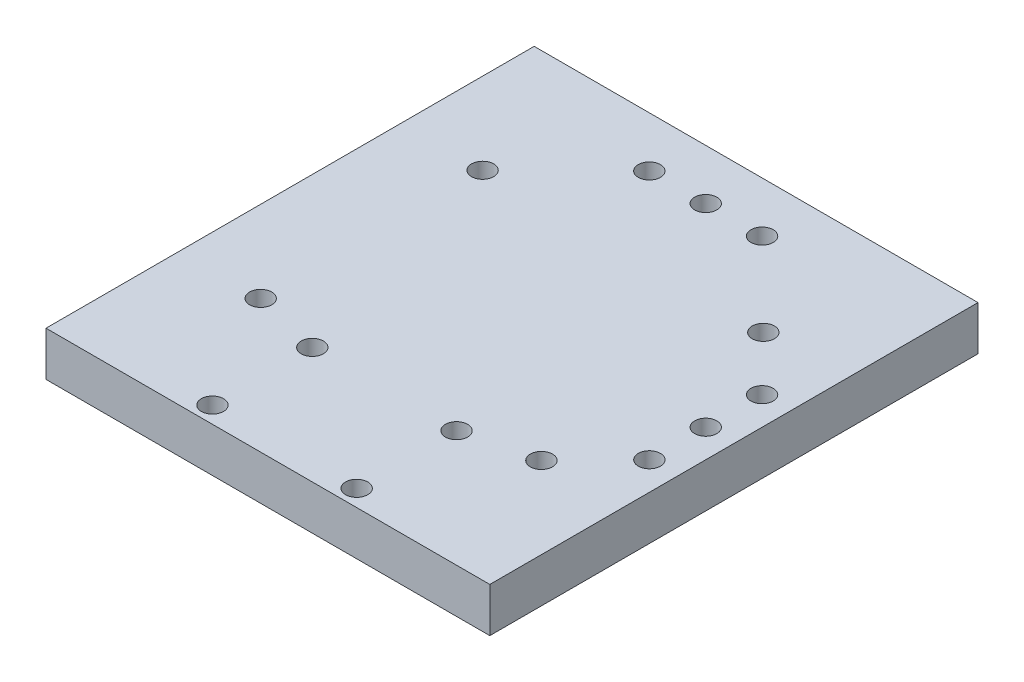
ISO-10303-21;
HEADER;
FILE_DESCRIPTION(('STEP AP214'),'2;1');
FILE_NAME('part.step','',(''),(''),'','','');
FILE_SCHEMA(('AUTOMOTIVE_DESIGN { 1 0 10303 214 1 1 1 1 }'));
ENDSEC;
DATA;
#1=APPLICATION_CONTEXT('core data for automotive mechanical design processes');
#2=APPLICATION_PROTOCOL_DEFINITION('international standard','automotive_design',2000,#1);
#3=PRODUCT_CONTEXT('',#1,'mechanical');
#4=PRODUCT('Part','Part','',(#3));
#5=PRODUCT_RELATED_PRODUCT_CATEGORY('part','',(#4));
#6=PRODUCT_DEFINITION_FORMATION('','',#4);
#7=PRODUCT_DEFINITION_CONTEXT('part definition',#1,'design');
#8=PRODUCT_DEFINITION('design','',#6,#7);
#9=PRODUCT_DEFINITION_SHAPE('','',#8);
#10=(LENGTH_UNIT() NAMED_UNIT(*) SI_UNIT(.MILLI.,.METRE.));
#11=(NAMED_UNIT(*) PLANE_ANGLE_UNIT() SI_UNIT($,.RADIAN.));
#12=(NAMED_UNIT(*) SI_UNIT($,.STERADIAN.) SOLID_ANGLE_UNIT());
#13=UNCERTAINTY_MEASURE_WITH_UNIT(LENGTH_MEASURE(1.E-05),#10,'distance_accuracy_value','');
#14=(GEOMETRIC_REPRESENTATION_CONTEXT(3) GLOBAL_UNCERTAINTY_ASSIGNED_CONTEXT((#13)) GLOBAL_UNIT_ASSIGNED_CONTEXT((#10,
#11,#12)) REPRESENTATION_CONTEXT('',''));
#15=CARTESIAN_POINT('',(0.,0.,0.));
#16=DIRECTION('',(0.,0.,1.));
#17=DIRECTION('',(1.,0.,0.));
#18=AXIS2_PLACEMENT_3D('',#15,#16,#17);
#19=CARTESIAN_POINT('',(0.,2.,0.));
#20=DIRECTION('',(0.,-1.,0.));
#21=DIRECTION('',(0.,0.,-1.));
#22=AXIS2_PLACEMENT_3D('',#19,#20,#21);
#23=PLANE('',#22);
#24=DIRECTION('',(0.,0.,-1.));
#25=VECTOR('',#24,1.);
#26=CARTESIAN_POINT('',(10.,2.,11.));
#27=LINE('',#26,#25);
#28=CARTESIAN_POINT('',(10.,2.,11.));
#29=VERTEX_POINT('',#28);
#30=CARTESIAN_POINT('',(10.,2.,-11.));
#31=VERTEX_POINT('',#30);
#32=EDGE_CURVE('E98',#29,#31,#27,.T.);
#33=ORIENTED_EDGE('',*,*,#32,.T.);
#34=DIRECTION('',(-1.,0.,0.));
#35=VECTOR('',#34,1.);
#36=CARTESIAN_POINT('',(-10.,2.,-11.));
#37=LINE('',#36,#35);
#38=CARTESIAN_POINT('',(-10.,2.,-11.));
#39=VERTEX_POINT('',#38);
#40=EDGE_CURVE('E93',#31,#39,#37,.T.);
#41=ORIENTED_EDGE('',*,*,#40,.T.);
#42=DIRECTION('',(0.,0.,1.));
#43=VECTOR('',#42,1.);
#44=CARTESIAN_POINT('',(-10.,2.,11.));
#45=LINE('',#44,#43);
#46=CARTESIAN_POINT('',(-10.,2.,11.));
#47=VERTEX_POINT('',#46);
#48=EDGE_CURVE('E96',#39,#47,#45,.T.);
#49=ORIENTED_EDGE('',*,*,#48,.T.);
#50=DIRECTION('',(1.,0.,0.));
#51=VECTOR('',#50,1.);
#52=CARTESIAN_POINT('',(-10.,2.,11.));
#53=LINE('',#52,#51);
#54=EDGE_CURVE('E63',#47,#29,#53,.T.);
#55=ORIENTED_EDGE('',*,*,#54,.T.);
#56=EDGE_LOOP('',(#33,#41,#49,#55));
#57=FACE_BOUND('',#56,.T.);
#58=CARTESIAN_POINT('',(2.54,2.,-8.73));
#59=DIRECTION('',(0.,1.,0.));
#60=DIRECTION('',(0.,0.,1.));
#61=AXIS2_PLACEMENT_3D('',#58,#59,#60);
#62=CIRCLE('',#61,0.5);
#63=CARTESIAN_POINT('',(2.54,2.,-8.23));
#64=VERTEX_POINT('',#63);
#65=EDGE_CURVE('E118',#64,#64,#62,.T.);
#66=ORIENTED_EDGE('',*,*,#65,.F.);
#67=EDGE_LOOP('',(#66));
#68=FACE_BOUND('',#67,.T.);
#69=CARTESIAN_POINT('',(6.325,2.,-5.));
#70=DIRECTION('',(0.,1.,0.));
#71=DIRECTION('',(0.,0.,1.));
#72=AXIS2_PLACEMENT_3D('',#69,#70,#71);
#73=CIRCLE('',#72,0.5);
#74=CARTESIAN_POINT('',(6.325,2.,-4.5));
#75=VERTEX_POINT('',#74);
#76=EDGE_CURVE('E140',#75,#75,#73,.T.);
#77=ORIENTED_EDGE('',*,*,#76,.F.);
#78=EDGE_LOOP('',(#77));
#79=FACE_BOUND('',#78,.T.);
#80=CARTESIAN_POINT('',(0.,2.,-8.73));
#81=DIRECTION('',(0.,1.,0.));
#82=DIRECTION('',(0.,0.,1.));
#83=AXIS2_PLACEMENT_3D('',#80,#81,#82);
#84=CIRCLE('',#83,0.5);
#85=CARTESIAN_POINT('',(0.,2.,-8.23));
#86=VERTEX_POINT('',#85);
#87=EDGE_CURVE('E148',#86,#86,#84,.T.);
#88=ORIENTED_EDGE('',*,*,#87,.F.);
#89=EDGE_LOOP('',(#88));
#90=FACE_BOUND('',#89,.T.);
#91=CARTESIAN_POINT('',(8.73,2.,0.));
#92=DIRECTION('',(0.,1.,0.));
#93=DIRECTION('',(0.,0.,1.));
#94=AXIS2_PLACEMENT_3D('',#91,#92,#93);
#95=CIRCLE('',#94,0.500000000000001);
#96=CARTESIAN_POINT('',(8.73,2.,0.500000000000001));
#97=VERTEX_POINT('',#96);
#98=EDGE_CURVE('E156',#97,#97,#95,.T.);
#99=ORIENTED_EDGE('',*,*,#98,.F.);
#100=EDGE_LOOP('',(#99));
#101=FACE_BOUND('',#100,.T.);
#102=CARTESIAN_POINT('',(-6.325,2.,-5.));
#103=DIRECTION('',(0.,1.,0.));
#104=DIRECTION('',(0.,0.,1.));
#105=AXIS2_PLACEMENT_3D('',#102,#103,#104);
#106=CIRCLE('',#105,0.5);
#107=CARTESIAN_POINT('',(-6.325,2.,-4.5));
#108=VERTEX_POINT('',#107);
#109=EDGE_CURVE('E164',#108,#108,#106,.T.);
#110=ORIENTED_EDGE('',*,*,#109,.F.);
#111=EDGE_LOOP('',(#110));
#112=FACE_BOUND('',#111,.T.);
#113=CARTESIAN_POINT('',(6.325,2.,5.));
#114=DIRECTION('',(0.,1.,0.));
#115=DIRECTION('',(0.,0.,1.));
#116=AXIS2_PLACEMENT_3D('',#113,#114,#115);
#117=CIRCLE('',#116,0.5);
#118=CARTESIAN_POINT('',(6.325,2.,5.5));
#119=VERTEX_POINT('',#118);
#120=EDGE_CURVE('E172',#119,#119,#117,.T.);
#121=ORIENTED_EDGE('',*,*,#120,.F.);
#122=EDGE_LOOP('',(#121));
#123=FACE_BOUND('',#122,.T.);
#124=CARTESIAN_POINT('',(-6.325,2.,5.));
#125=DIRECTION('',(0.,1.,0.));
#126=DIRECTION('',(0.,0.,1.));
#127=AXIS2_PLACEMENT_3D('',#124,#125,#126);
#128=CIRCLE('',#127,0.5);
#129=CARTESIAN_POINT('',(-6.325,2.,5.5));
#130=VERTEX_POINT('',#129);
#131=EDGE_CURVE('E180',#130,#130,#128,.T.);
#132=ORIENTED_EDGE('',*,*,#131,.F.);
#133=EDGE_LOOP('',(#132));
#134=FACE_BOUND('',#133,.T.);
#135=CARTESIAN_POINT('',(-2.54,2.,-8.73));
#136=DIRECTION('',(0.,1.,0.));
#137=DIRECTION('',(0.,0.,1.));
#138=AXIS2_PLACEMENT_3D('',#135,#136,#137);
#139=CIRCLE('',#138,0.5);
#140=CARTESIAN_POINT('',(-2.54,2.,-8.23));
#141=VERTEX_POINT('',#140);
#142=EDGE_CURVE('E188',#141,#141,#139,.T.);
#143=ORIENTED_EDGE('',*,*,#142,.F.);
#144=EDGE_LOOP('',(#143));
#145=FACE_BOUND('',#144,.T.);
#146=CARTESIAN_POINT('',(8.73,2.,-2.54));
#147=DIRECTION('',(0.,1.,0.));
#148=DIRECTION('',(0.,0.,1.));
#149=AXIS2_PLACEMENT_3D('',#146,#147,#148);
#150=CIRCLE('',#149,0.500000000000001);
#151=CARTESIAN_POINT('',(8.73,2.,-2.04));
#152=VERTEX_POINT('',#151);
#153=EDGE_CURVE('E196',#152,#152,#150,.T.);
#154=ORIENTED_EDGE('',*,*,#153,.F.);
#155=EDGE_LOOP('',(#154));
#156=FACE_BOUND('',#155,.T.);
#157=CARTESIAN_POINT('',(8.73,2.,2.54));
#158=DIRECTION('',(0.,1.,0.));
#159=DIRECTION('',(0.,0.,1.));
#160=AXIS2_PLACEMENT_3D('',#157,#158,#159);
#161=CIRCLE('',#160,0.500000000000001);
#162=CARTESIAN_POINT('',(8.73,2.,3.04));
#163=VERTEX_POINT('',#162);
#164=EDGE_CURVE('E204',#163,#163,#161,.T.);
#165=ORIENTED_EDGE('',*,*,#164,.F.);
#166=EDGE_LOOP('',(#165));
#167=FACE_BOUND('',#166,.T.);
#168=CARTESIAN_POINT('',(-3.25,2.,5.75));
#169=DIRECTION('',(0.,1.,0.));
#170=DIRECTION('',(0.,0.,1.));
#171=AXIS2_PLACEMENT_3D('',#168,#169,#170);
#172=CIRCLE('',#171,0.5);
#173=CARTESIAN_POINT('',(-3.25,2.,6.25));
#174=VERTEX_POINT('',#173);
#175=EDGE_CURVE('E212',#174,#174,#172,.T.);
#176=ORIENTED_EDGE('',*,*,#175,.F.);
#177=EDGE_LOOP('',(#176));
#178=FACE_BOUND('',#177,.T.);
#179=CARTESIAN_POINT('',(3.25,2.,5.75));
#180=DIRECTION('',(0.,1.,0.));
#181=DIRECTION('',(0.,0.,1.));
#182=AXIS2_PLACEMENT_3D('',#179,#180,#181);
#183=CIRCLE('',#182,0.5);
#184=CARTESIAN_POINT('',(3.25,2.,6.25));
#185=VERTEX_POINT('',#184);
#186=EDGE_CURVE('E220',#185,#185,#183,.T.);
#187=ORIENTED_EDGE('',*,*,#186,.F.);
#188=EDGE_LOOP('',(#187));
#189=FACE_BOUND('',#188,.T.);
#190=CARTESIAN_POINT('',(3.25,2.,10.25));
#191=DIRECTION('',(0.,1.,0.));
#192=DIRECTION('',(0.,0.,1.));
#193=AXIS2_PLACEMENT_3D('',#190,#191,#192);
#194=CIRCLE('',#193,0.5);
#195=CARTESIAN_POINT('',(3.25,2.,10.75));
#196=VERTEX_POINT('',#195);
#197=EDGE_CURVE('E228',#196,#196,#194,.T.);
#198=ORIENTED_EDGE('',*,*,#197,.F.);
#199=EDGE_LOOP('',(#198));
#200=FACE_BOUND('',#199,.T.);
#201=CARTESIAN_POINT('',(-3.25,2.,10.25));
#202=DIRECTION('',(0.,1.,0.));
#203=DIRECTION('',(0.,0.,1.));
#204=AXIS2_PLACEMENT_3D('',#201,#202,#203);
#205=CIRCLE('',#204,0.5);
#206=CARTESIAN_POINT('',(-3.25,2.,10.75));
#207=VERTEX_POINT('',#206);
#208=EDGE_CURVE('E236',#207,#207,#205,.T.);
#209=ORIENTED_EDGE('',*,*,#208,.F.);
#210=EDGE_LOOP('',(#209));
#211=FACE_BOUND('',#210,.T.);
#212=ADVANCED_FACE('F45',(#57,#68,#79,#90,#101,#112,#123,#134,#145,#156,#167,#178,#189,#200,
#211),#23,.F.);
#213=CARTESIAN_POINT('',(0.,0.,0.));
#214=DIRECTION('',(0.,-1.,0.));
#215=DIRECTION('',(0.,0.,-1.));
#216=AXIS2_PLACEMENT_3D('',#213,#214,#215);
#217=PLANE('',#216);
#218=CARTESIAN_POINT('',(3.25,0.,10.25));
#219=DIRECTION('',(0.,1.,0.));
#220=DIRECTION('',(0.,0.,1.));
#221=AXIS2_PLACEMENT_3D('',#218,#219,#220);
#222=CIRCLE('',#221,0.5);
#223=CARTESIAN_POINT('',(3.25,0.,10.75));
#224=VERTEX_POINT('',#223);
#225=EDGE_CURVE('E232',#224,#224,#222,.T.);
#226=ORIENTED_EDGE('',*,*,#225,.T.);
#227=EDGE_LOOP('',(#226));
#228=FACE_BOUND('',#227,.T.);
#229=CARTESIAN_POINT('',(-3.25,0.,5.75));
#230=DIRECTION('',(0.,1.,0.));
#231=DIRECTION('',(0.,0.,1.));
#232=AXIS2_PLACEMENT_3D('',#229,#230,#231);
#233=CIRCLE('',#232,0.5);
#234=CARTESIAN_POINT('',(-3.25,0.,6.25));
#235=VERTEX_POINT('',#234);
#236=EDGE_CURVE('E216',#235,#235,#233,.T.);
#237=ORIENTED_EDGE('',*,*,#236,.T.);
#238=EDGE_LOOP('',(#237));
#239=FACE_BOUND('',#238,.T.);
#240=CARTESIAN_POINT('',(8.73,0.,-2.54));
#241=DIRECTION('',(0.,1.,0.));
#242=DIRECTION('',(0.,0.,1.));
#243=AXIS2_PLACEMENT_3D('',#240,#241,#242);
#244=CIRCLE('',#243,0.500000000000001);
#245=CARTESIAN_POINT('',(8.73,0.,-2.04));
#246=VERTEX_POINT('',#245);
#247=EDGE_CURVE('E200',#246,#246,#244,.T.);
#248=ORIENTED_EDGE('',*,*,#247,.T.);
#249=EDGE_LOOP('',(#248));
#250=FACE_BOUND('',#249,.T.);
#251=CARTESIAN_POINT('',(-6.325,0.,5.));
#252=DIRECTION('',(0.,1.,0.));
#253=DIRECTION('',(0.,0.,1.));
#254=AXIS2_PLACEMENT_3D('',#251,#252,#253);
#255=CIRCLE('',#254,0.5);
#256=CARTESIAN_POINT('',(-6.325,0.,5.5));
#257=VERTEX_POINT('',#256);
#258=EDGE_CURVE('E184',#257,#257,#255,.T.);
#259=ORIENTED_EDGE('',*,*,#258,.T.);
#260=EDGE_LOOP('',(#259));
#261=FACE_BOUND('',#260,.T.);
#262=CARTESIAN_POINT('',(-6.325,0.,-5.));
#263=DIRECTION('',(0.,1.,0.));
#264=DIRECTION('',(0.,0.,1.));
#265=AXIS2_PLACEMENT_3D('',#262,#263,#264);
#266=CIRCLE('',#265,0.5);
#267=CARTESIAN_POINT('',(-6.325,0.,-4.5));
#268=VERTEX_POINT('',#267);
#269=EDGE_CURVE('E168',#268,#268,#266,.T.);
#270=ORIENTED_EDGE('',*,*,#269,.T.);
#271=EDGE_LOOP('',(#270));
#272=FACE_BOUND('',#271,.T.);
#273=CARTESIAN_POINT('',(0.,0.,-8.73));
#274=DIRECTION('',(0.,1.,0.));
#275=DIRECTION('',(0.,0.,1.));
#276=AXIS2_PLACEMENT_3D('',#273,#274,#275);
#277=CIRCLE('',#276,0.5);
#278=CARTESIAN_POINT('',(0.,0.,-8.23));
#279=VERTEX_POINT('',#278);
#280=EDGE_CURVE('E152',#279,#279,#277,.T.);
#281=ORIENTED_EDGE('',*,*,#280,.T.);
#282=EDGE_LOOP('',(#281));
#283=FACE_BOUND('',#282,.T.);
#284=CARTESIAN_POINT('',(2.54,0.,-8.73));
#285=DIRECTION('',(0.,1.,0.));
#286=DIRECTION('',(0.,0.,1.));
#287=AXIS2_PLACEMENT_3D('',#284,#285,#286);
#288=CIRCLE('',#287,0.5);
#289=CARTESIAN_POINT('',(2.54,0.,-8.23));
#290=VERTEX_POINT('',#289);
#291=EDGE_CURVE('E136',#290,#290,#288,.T.);
#292=ORIENTED_EDGE('',*,*,#291,.T.);
#293=EDGE_LOOP('',(#292));
#294=FACE_BOUND('',#293,.T.);
#295=DIRECTION('',(0.,0.,-1.));
#296=VECTOR('',#295,1.);
#297=CARTESIAN_POINT('',(10.,0.,11.));
#298=LINE('',#297,#296);
#299=CARTESIAN_POINT('',(10.,0.,11.));
#300=VERTEX_POINT('',#299);
#301=CARTESIAN_POINT('',(10.,0.,-11.));
#302=VERTEX_POINT('',#301);
#303=EDGE_CURVE('E114',#300,#302,#298,.T.);
#304=ORIENTED_EDGE('',*,*,#303,.F.);
#305=DIRECTION('',(1.,0.,0.));
#306=VECTOR('',#305,1.);
#307=CARTESIAN_POINT('',(-10.,0.,11.));
#308=LINE('',#307,#306);
#309=CARTESIAN_POINT('',(-10.,0.,11.));
#310=VERTEX_POINT('',#309);
#311=EDGE_CURVE('E86',#310,#300,#308,.T.);
#312=ORIENTED_EDGE('',*,*,#311,.F.);
#313=DIRECTION('',(0.,0.,1.));
#314=VECTOR('',#313,1.);
#315=CARTESIAN_POINT('',(-10.,0.,11.));
#316=LINE('',#315,#314);
#317=CARTESIAN_POINT('',(-10.,0.,-11.));
#318=VERTEX_POINT('',#317);
#319=EDGE_CURVE('E80',#318,#310,#316,.T.);
#320=ORIENTED_EDGE('',*,*,#319,.F.);
#321=DIRECTION('',(-1.,0.,0.));
#322=VECTOR('',#321,1.);
#323=CARTESIAN_POINT('',(-10.,0.,-11.));
#324=LINE('',#323,#322);
#325=EDGE_CURVE('E103',#302,#318,#324,.T.);
#326=ORIENTED_EDGE('',*,*,#325,.F.);
#327=EDGE_LOOP('',(#304,#312,#320,#326));
#328=FACE_BOUND('',#327,.T.);
#329=CARTESIAN_POINT('',(6.325,0.,-5.));
#330=DIRECTION('',(0.,1.,0.));
#331=DIRECTION('',(0.,0.,1.));
#332=AXIS2_PLACEMENT_3D('',#329,#330,#331);
#333=CIRCLE('',#332,0.5);
#334=CARTESIAN_POINT('',(6.325,0.,-4.5));
#335=VERTEX_POINT('',#334);
#336=EDGE_CURVE('E144',#335,#335,#333,.T.);
#337=ORIENTED_EDGE('',*,*,#336,.T.);
#338=EDGE_LOOP('',(#337));
#339=FACE_BOUND('',#338,.T.);
#340=CARTESIAN_POINT('',(8.73,0.,0.));
#341=DIRECTION('',(0.,1.,0.));
#342=DIRECTION('',(0.,0.,1.));
#343=AXIS2_PLACEMENT_3D('',#340,#341,#342);
#344=CIRCLE('',#343,0.500000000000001);
#345=CARTESIAN_POINT('',(8.73,0.,0.500000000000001));
#346=VERTEX_POINT('',#345);
#347=EDGE_CURVE('E160',#346,#346,#344,.T.);
#348=ORIENTED_EDGE('',*,*,#347,.T.);
#349=EDGE_LOOP('',(#348));
#350=FACE_BOUND('',#349,.T.);
#351=CARTESIAN_POINT('',(6.325,0.,5.));
#352=DIRECTION('',(0.,1.,0.));
#353=DIRECTION('',(0.,0.,1.));
#354=AXIS2_PLACEMENT_3D('',#351,#352,#353);
#355=CIRCLE('',#354,0.5);
#356=CARTESIAN_POINT('',(6.325,0.,5.5));
#357=VERTEX_POINT('',#356);
#358=EDGE_CURVE('E176',#357,#357,#355,.T.);
#359=ORIENTED_EDGE('',*,*,#358,.T.);
#360=EDGE_LOOP('',(#359));
#361=FACE_BOUND('',#360,.T.);
#362=CARTESIAN_POINT('',(-2.54,0.,-8.73));
#363=DIRECTION('',(0.,1.,0.));
#364=DIRECTION('',(0.,0.,1.));
#365=AXIS2_PLACEMENT_3D('',#362,#363,#364);
#366=CIRCLE('',#365,0.5);
#367=CARTESIAN_POINT('',(-2.54,0.,-8.23));
#368=VERTEX_POINT('',#367);
#369=EDGE_CURVE('E192',#368,#368,#366,.T.);
#370=ORIENTED_EDGE('',*,*,#369,.T.);
#371=EDGE_LOOP('',(#370));
#372=FACE_BOUND('',#371,.T.);
#373=CARTESIAN_POINT('',(8.73,0.,2.54));
#374=DIRECTION('',(0.,1.,0.));
#375=DIRECTION('',(0.,0.,1.));
#376=AXIS2_PLACEMENT_3D('',#373,#374,#375);
#377=CIRCLE('',#376,0.500000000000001);
#378=CARTESIAN_POINT('',(8.73,0.,3.04));
#379=VERTEX_POINT('',#378);
#380=EDGE_CURVE('E208',#379,#379,#377,.T.);
#381=ORIENTED_EDGE('',*,*,#380,.T.);
#382=EDGE_LOOP('',(#381));
#383=FACE_BOUND('',#382,.T.);
#384=CARTESIAN_POINT('',(3.25,0.,5.75));
#385=DIRECTION('',(0.,1.,0.));
#386=DIRECTION('',(0.,0.,1.));
#387=AXIS2_PLACEMENT_3D('',#384,#385,#386);
#388=CIRCLE('',#387,0.5);
#389=CARTESIAN_POINT('',(3.25,0.,6.25));
#390=VERTEX_POINT('',#389);
#391=EDGE_CURVE('E224',#390,#390,#388,.T.);
#392=ORIENTED_EDGE('',*,*,#391,.T.);
#393=EDGE_LOOP('',(#392));
#394=FACE_BOUND('',#393,.T.);
#395=CARTESIAN_POINT('',(-3.25,0.,10.25));
#396=DIRECTION('',(0.,1.,0.));
#397=DIRECTION('',(0.,0.,1.));
#398=AXIS2_PLACEMENT_3D('',#395,#396,#397);
#399=CIRCLE('',#398,0.5);
#400=CARTESIAN_POINT('',(-3.25,0.,10.75));
#401=VERTEX_POINT('',#400);
#402=EDGE_CURVE('E240',#401,#401,#399,.T.);
#403=ORIENTED_EDGE('',*,*,#402,.T.);
#404=EDGE_LOOP('',(#403));
#405=FACE_BOUND('',#404,.T.);
#406=ADVANCED_FACE('F131',(#228,#239,#250,#261,#272,#283,#294,#328,#339,#350,#361,#372,#383,
#394,#405),#217,.T.);
#407=CARTESIAN_POINT('',(10.,2.,11.));
#408=DIRECTION('',(-1.,0.,0.));
#409=DIRECTION('',(0.,0.,1.));
#410=AXIS2_PLACEMENT_3D('',#407,#408,#409);
#411=PLANE('',#410);
#412=ORIENTED_EDGE('',*,*,#303,.T.);
#413=DIRECTION('',(0.,-1.,0.));
#414=VECTOR('',#413,1.);
#415=CARTESIAN_POINT('',(10.,2.,-11.));
#416=LINE('',#415,#414);
#417=EDGE_CURVE('E11',#31,#302,#416,.T.);
#418=ORIENTED_EDGE('',*,*,#417,.F.);
#419=ORIENTED_EDGE('',*,*,#32,.F.);
#420=DIRECTION('',(0.,-1.,0.));
#421=VECTOR('',#420,1.);
#422=CARTESIAN_POINT('',(10.,2.,11.));
#423=LINE('',#422,#421);
#424=EDGE_CURVE('E110',#29,#300,#423,.T.);
#425=ORIENTED_EDGE('',*,*,#424,.T.);
#426=EDGE_LOOP('',(#412,#418,#419,#425));
#427=FACE_BOUND('',#426,.T.);
#428=ADVANCED_FACE('F47',(#427),#411,.F.);
#429=CARTESIAN_POINT('',(-10.,2.,-11.));
#430=DIRECTION('',(0.,0.,1.));
#431=DIRECTION('',(1.,0.,0.));
#432=AXIS2_PLACEMENT_3D('',#429,#430,#431);
#433=PLANE('',#432);
#434=ORIENTED_EDGE('',*,*,#325,.T.);
#435=DIRECTION('',(0.,-1.,0.));
#436=VECTOR('',#435,1.);
#437=CARTESIAN_POINT('',(-10.,2.,-11.));
#438=LINE('',#437,#436);
#439=EDGE_CURVE('E55',#39,#318,#438,.T.);
#440=ORIENTED_EDGE('',*,*,#439,.F.);
#441=ORIENTED_EDGE('',*,*,#40,.F.);
#442=ORIENTED_EDGE('',*,*,#417,.T.);
#443=EDGE_LOOP('',(#434,#440,#441,#442));
#444=FACE_BOUND('',#443,.T.);
#445=ADVANCED_FACE('F102',(#444),#433,.F.);
#446=CARTESIAN_POINT('',(-10.,2.,11.));
#447=DIRECTION('',(1.,0.,0.));
#448=DIRECTION('',(0.,0.,-1.));
#449=AXIS2_PLACEMENT_3D('',#446,#447,#448);
#450=PLANE('',#449);
#451=ORIENTED_EDGE('',*,*,#319,.T.);
#452=DIRECTION('',(0.,-1.,0.));
#453=VECTOR('',#452,1.);
#454=CARTESIAN_POINT('',(-10.,2.,11.));
#455=LINE('',#454,#453);
#456=EDGE_CURVE('E105',#47,#310,#455,.T.);
#457=ORIENTED_EDGE('',*,*,#456,.F.);
#458=ORIENTED_EDGE('',*,*,#48,.F.);
#459=ORIENTED_EDGE('',*,*,#439,.T.);
#460=EDGE_LOOP('',(#451,#457,#458,#459));
#461=FACE_BOUND('',#460,.T.);
#462=ADVANCED_FACE('F106',(#461),#450,.F.);
#463=CARTESIAN_POINT('',(-10.,2.,11.));
#464=DIRECTION('',(0.,0.,-1.));
#465=DIRECTION('',(-1.,0.,0.));
#466=AXIS2_PLACEMENT_3D('',#463,#464,#465);
#467=PLANE('',#466);
#468=ORIENTED_EDGE('',*,*,#311,.T.);
#469=ORIENTED_EDGE('',*,*,#424,.F.);
#470=ORIENTED_EDGE('',*,*,#54,.F.);
#471=ORIENTED_EDGE('',*,*,#456,.T.);
#472=EDGE_LOOP('',(#468,#469,#470,#471));
#473=FACE_BOUND('',#472,.T.);
#474=ADVANCED_FACE('F128',(#473),#467,.F.);
#475=CARTESIAN_POINT('',(2.54,2.,-8.73));
#476=DIRECTION('',(0.,-1.,0.));
#477=DIRECTION('',(0.,0.,-1.));
#478=AXIS2_PLACEMENT_3D('',#475,#476,#477);
#479=CYLINDRICAL_SURFACE('',#478,0.5);
#480=ORIENTED_EDGE('',*,*,#65,.T.);
#481=EDGE_LOOP('',(#480));
#482=FACE_BOUND('',#481,.T.);
#483=ORIENTED_EDGE('',*,*,#291,.F.);
#484=EDGE_LOOP('',(#483));
#485=FACE_BOUND('',#484,.T.);
#486=ADVANCED_FACE('F259',(#482,#485),#479,.F.);
#487=CARTESIAN_POINT('',(6.325,2.,-5.));
#488=DIRECTION('',(0.,-1.,0.));
#489=DIRECTION('',(0.,0.,-1.));
#490=AXIS2_PLACEMENT_3D('',#487,#488,#489);
#491=CYLINDRICAL_SURFACE('',#490,0.5);
#492=ORIENTED_EDGE('',*,*,#76,.T.);
#493=EDGE_LOOP('',(#492));
#494=FACE_BOUND('',#493,.T.);
#495=ORIENTED_EDGE('',*,*,#336,.F.);
#496=EDGE_LOOP('',(#495));
#497=FACE_BOUND('',#496,.T.);
#498=ADVANCED_FACE('F304',(#494,#497),#491,.F.);
#499=CARTESIAN_POINT('',(0.,2.,-8.73));
#500=DIRECTION('',(0.,-1.,0.));
#501=DIRECTION('',(0.,0.,-1.));
#502=AXIS2_PLACEMENT_3D('',#499,#500,#501);
#503=CYLINDRICAL_SURFACE('',#502,0.5);
#504=ORIENTED_EDGE('',*,*,#87,.T.);
#505=EDGE_LOOP('',(#504));
#506=FACE_BOUND('',#505,.T.);
#507=ORIENTED_EDGE('',*,*,#280,.F.);
#508=EDGE_LOOP('',(#507));
#509=FACE_BOUND('',#508,.T.);
#510=ADVANCED_FACE('F312',(#506,#509),#503,.F.);
#511=CARTESIAN_POINT('',(8.73,2.,0.));
#512=DIRECTION('',(0.,-1.,0.));
#513=DIRECTION('',(0.,0.,-1.));
#514=AXIS2_PLACEMENT_3D('',#511,#512,#513);
#515=CYLINDRICAL_SURFACE('',#514,0.500000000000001);
#516=ORIENTED_EDGE('',*,*,#98,.T.);
#517=EDGE_LOOP('',(#516));
#518=FACE_BOUND('',#517,.T.);
#519=ORIENTED_EDGE('',*,*,#347,.F.);
#520=EDGE_LOOP('',(#519));
#521=FACE_BOUND('',#520,.T.);
#522=ADVANCED_FACE('F320',(#518,#521),#515,.F.);
#523=CARTESIAN_POINT('',(-6.325,2.,-5.));
#524=DIRECTION('',(0.,-1.,0.));
#525=DIRECTION('',(0.,0.,-1.));
#526=AXIS2_PLACEMENT_3D('',#523,#524,#525);
#527=CYLINDRICAL_SURFACE('',#526,0.5);
#528=ORIENTED_EDGE('',*,*,#109,.T.);
#529=EDGE_LOOP('',(#528));
#530=FACE_BOUND('',#529,.T.);
#531=ORIENTED_EDGE('',*,*,#269,.F.);
#532=EDGE_LOOP('',(#531));
#533=FACE_BOUND('',#532,.T.);
#534=ADVANCED_FACE('F329',(#530,#533),#527,.F.);
#535=CARTESIAN_POINT('',(6.325,2.,5.));
#536=DIRECTION('',(0.,-1.,0.));
#537=DIRECTION('',(0.,0.,-1.));
#538=AXIS2_PLACEMENT_3D('',#535,#536,#537);
#539=CYLINDRICAL_SURFACE('',#538,0.5);
#540=ORIENTED_EDGE('',*,*,#120,.T.);
#541=EDGE_LOOP('',(#540));
#542=FACE_BOUND('',#541,.T.);
#543=ORIENTED_EDGE('',*,*,#358,.F.);
#544=EDGE_LOOP('',(#543));
#545=FACE_BOUND('',#544,.T.);
#546=ADVANCED_FACE('F338',(#542,#545),#539,.F.);
#547=CARTESIAN_POINT('',(-6.325,2.,5.));
#548=DIRECTION('',(0.,-1.,0.));
#549=DIRECTION('',(0.,0.,-1.));
#550=AXIS2_PLACEMENT_3D('',#547,#548,#549);
#551=CYLINDRICAL_SURFACE('',#550,0.5);
#552=ORIENTED_EDGE('',*,*,#131,.T.);
#553=EDGE_LOOP('',(#552));
#554=FACE_BOUND('',#553,.T.);
#555=ORIENTED_EDGE('',*,*,#258,.F.);
#556=EDGE_LOOP('',(#555));
#557=FACE_BOUND('',#556,.T.);
#558=ADVANCED_FACE('F347',(#554,#557),#551,.F.);
#559=CARTESIAN_POINT('',(-2.54,2.,-8.73));
#560=DIRECTION('',(0.,-1.,0.));
#561=DIRECTION('',(0.,0.,-1.));
#562=AXIS2_PLACEMENT_3D('',#559,#560,#561);
#563=CYLINDRICAL_SURFACE('',#562,0.5);
#564=ORIENTED_EDGE('',*,*,#142,.T.);
#565=EDGE_LOOP('',(#564));
#566=FACE_BOUND('',#565,.T.);
#567=ORIENTED_EDGE('',*,*,#369,.F.);
#568=EDGE_LOOP('',(#567));
#569=FACE_BOUND('',#568,.T.);
#570=ADVANCED_FACE('F356',(#566,#569),#563,.F.);
#571=CARTESIAN_POINT('',(8.73,2.,-2.54));
#572=DIRECTION('',(0.,-1.,0.));
#573=DIRECTION('',(0.,0.,-1.));
#574=AXIS2_PLACEMENT_3D('',#571,#572,#573);
#575=CYLINDRICAL_SURFACE('',#574,0.500000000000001);
#576=ORIENTED_EDGE('',*,*,#153,.T.);
#577=EDGE_LOOP('',(#576));
#578=FACE_BOUND('',#577,.T.);
#579=ORIENTED_EDGE('',*,*,#247,.F.);
#580=EDGE_LOOP('',(#579));
#581=FACE_BOUND('',#580,.T.);
#582=ADVANCED_FACE('F365',(#578,#581),#575,.F.);
#583=CARTESIAN_POINT('',(8.73,2.,2.54));
#584=DIRECTION('',(0.,-1.,0.));
#585=DIRECTION('',(0.,0.,-1.));
#586=AXIS2_PLACEMENT_3D('',#583,#584,#585);
#587=CYLINDRICAL_SURFACE('',#586,0.500000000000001);
#588=ORIENTED_EDGE('',*,*,#164,.T.);
#589=EDGE_LOOP('',(#588));
#590=FACE_BOUND('',#589,.T.);
#591=ORIENTED_EDGE('',*,*,#380,.F.);
#592=EDGE_LOOP('',(#591));
#593=FACE_BOUND('',#592,.T.);
#594=ADVANCED_FACE('F374',(#590,#593),#587,.F.);
#595=CARTESIAN_POINT('',(-3.25,2.,5.75));
#596=DIRECTION('',(0.,-1.,0.));
#597=DIRECTION('',(0.,0.,-1.));
#598=AXIS2_PLACEMENT_3D('',#595,#596,#597);
#599=CYLINDRICAL_SURFACE('',#598,0.5);
#600=ORIENTED_EDGE('',*,*,#175,.T.);
#601=EDGE_LOOP('',(#600));
#602=FACE_BOUND('',#601,.T.);
#603=ORIENTED_EDGE('',*,*,#236,.F.);
#604=EDGE_LOOP('',(#603));
#605=FACE_BOUND('',#604,.T.);
#606=ADVANCED_FACE('F383',(#602,#605),#599,.F.);
#607=CARTESIAN_POINT('',(3.25,2.,5.75));
#608=DIRECTION('',(0.,-1.,0.));
#609=DIRECTION('',(0.,0.,-1.));
#610=AXIS2_PLACEMENT_3D('',#607,#608,#609);
#611=CYLINDRICAL_SURFACE('',#610,0.5);
#612=ORIENTED_EDGE('',*,*,#186,.T.);
#613=EDGE_LOOP('',(#612));
#614=FACE_BOUND('',#613,.T.);
#615=ORIENTED_EDGE('',*,*,#391,.F.);
#616=EDGE_LOOP('',(#615));
#617=FACE_BOUND('',#616,.T.);
#618=ADVANCED_FACE('F392',(#614,#617),#611,.F.);
#619=CARTESIAN_POINT('',(3.25,2.,10.25));
#620=DIRECTION('',(0.,-1.,0.));
#621=DIRECTION('',(0.,0.,-1.));
#622=AXIS2_PLACEMENT_3D('',#619,#620,#621);
#623=CYLINDRICAL_SURFACE('',#622,0.5);
#624=ORIENTED_EDGE('',*,*,#197,.T.);
#625=EDGE_LOOP('',(#624));
#626=FACE_BOUND('',#625,.T.);
#627=ORIENTED_EDGE('',*,*,#225,.F.);
#628=EDGE_LOOP('',(#627));
#629=FACE_BOUND('',#628,.T.);
#630=ADVANCED_FACE('F401',(#626,#629),#623,.F.);
#631=CARTESIAN_POINT('',(-3.25,2.,10.25));
#632=DIRECTION('',(0.,-1.,0.));
#633=DIRECTION('',(0.,0.,-1.));
#634=AXIS2_PLACEMENT_3D('',#631,#632,#633);
#635=CYLINDRICAL_SURFACE('',#634,0.5);
#636=ORIENTED_EDGE('',*,*,#208,.T.);
#637=EDGE_LOOP('',(#636));
#638=FACE_BOUND('',#637,.T.);
#639=ORIENTED_EDGE('',*,*,#402,.F.);
#640=EDGE_LOOP('',(#639));
#641=FACE_BOUND('',#640,.T.);
#642=ADVANCED_FACE('F248',(#638,#641),#635,.F.);
#643=CLOSED_SHELL('',(#212,#406,#428,#445,#462,#474,#486,#498,#510,#522,#534,#546,#558,#570,
#582,#594,#606,#618,#630,#642));
#644=MANIFOLD_SOLID_BREP('B2',#643);
#645=ADVANCED_BREP_SHAPE_REPRESENTATION('',(#18,#644),#14);
#646=SHAPE_DEFINITION_REPRESENTATION(#9,#645);
ENDSEC;
END-ISO-10303-21;
